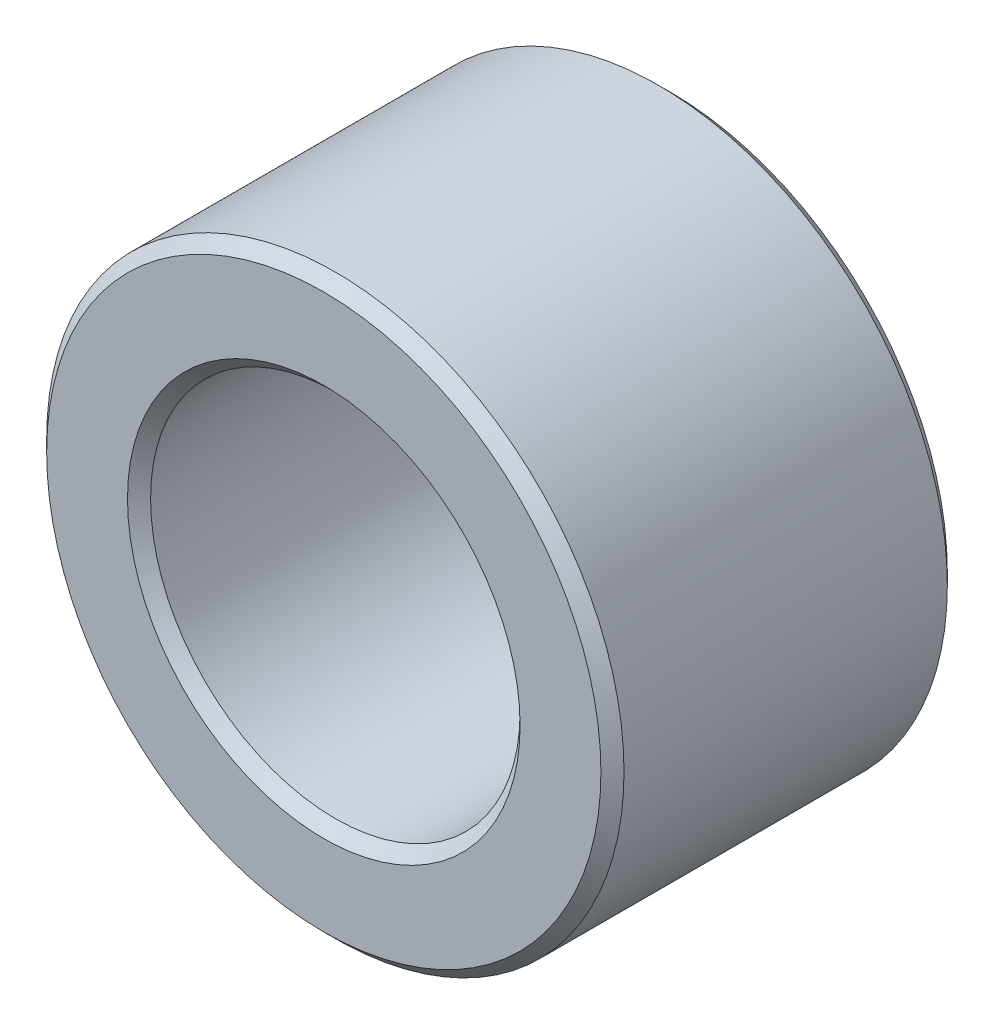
ISO-10303-21;
HEADER;
FILE_DESCRIPTION(('STEP AP214'),'2;1');
FILE_NAME('part.step','',(''),(''),'','','');
FILE_SCHEMA(('AUTOMOTIVE_DESIGN { 1 0 10303 214 1 1 1 1 }'));
ENDSEC;
DATA;
#1=APPLICATION_CONTEXT('core data for automotive mechanical design processes');
#2=APPLICATION_PROTOCOL_DEFINITION('international standard','automotive_design',2000,#1);
#3=PRODUCT_CONTEXT('',#1,'mechanical');
#4=PRODUCT('Part','Part','',(#3));
#5=PRODUCT_RELATED_PRODUCT_CATEGORY('part','',(#4));
#6=PRODUCT_DEFINITION_FORMATION('','',#4);
#7=PRODUCT_DEFINITION_CONTEXT('part definition',#1,'design');
#8=PRODUCT_DEFINITION('design','',#6,#7);
#9=PRODUCT_DEFINITION_SHAPE('','',#8);
#10=(LENGTH_UNIT() NAMED_UNIT(*) SI_UNIT(.MILLI.,.METRE.));
#11=(NAMED_UNIT(*) PLANE_ANGLE_UNIT() SI_UNIT($,.RADIAN.));
#12=(NAMED_UNIT(*) SI_UNIT($,.STERADIAN.) SOLID_ANGLE_UNIT());
#13=UNCERTAINTY_MEASURE_WITH_UNIT(LENGTH_MEASURE(1.E-05),#10,'distance_accuracy_value','');
#14=(GEOMETRIC_REPRESENTATION_CONTEXT(3) GLOBAL_UNCERTAINTY_ASSIGNED_CONTEXT((#13)) GLOBAL_UNIT_ASSIGNED_CONTEXT((#10,
#11,#12)) REPRESENTATION_CONTEXT('',''));
#15=CARTESIAN_POINT('',(0.,0.,0.));
#16=DIRECTION('',(0.,0.,1.));
#17=DIRECTION('',(1.,0.,0.));
#18=AXIS2_PLACEMENT_3D('',#15,#16,#17);
#19=CARTESIAN_POINT('',(0.,0.,3.));
#20=DIRECTION('',(0.,0.,1.));
#21=DIRECTION('',(1.,0.,0.));
#22=AXIS2_PLACEMENT_3D('',#19,#20,#21);
#23=PLANE('',#22);
#24=CARTESIAN_POINT('',(0.,0.,3.));
#25=DIRECTION('',(0.,0.,1.));
#26=DIRECTION('',(1.,0.,0.));
#27=AXIS2_PLACEMENT_3D('',#24,#25,#26);
#28=CIRCLE('',#27,3.4);
#29=CARTESIAN_POINT('',(3.4,0.,3.));
#30=VERTEX_POINT('',#29);
#31=EDGE_CURVE('E10',#30,#30,#28,.F.);
#32=ORIENTED_EDGE('',*,*,#31,.T.);
#33=EDGE_LOOP('',(#32));
#34=FACE_BOUND('',#33,.T.);
#35=CARTESIAN_POINT('',(0.,0.,3.));
#36=DIRECTION('',(0.,0.,1.));
#37=DIRECTION('',(1.,0.,0.));
#38=AXIS2_PLACEMENT_3D('',#35,#36,#37);
#39=CIRCLE('',#38,4.8);
#40=CARTESIAN_POINT('',(4.8,0.,3.));
#41=VERTEX_POINT('',#40);
#42=EDGE_CURVE('E45',#41,#41,#39,.T.);
#43=ORIENTED_EDGE('',*,*,#42,.T.);
#44=EDGE_LOOP('',(#43));
#45=FACE_BOUND('',#44,.T.);
#46=ADVANCED_FACE('F37',(#34,#45),#23,.T.);
#47=CARTESIAN_POINT('',(0.,0.,-3.));
#48=DIRECTION('',(0.,0.,1.));
#49=DIRECTION('',(1.,0.,0.));
#50=AXIS2_PLACEMENT_3D('',#47,#48,#49);
#51=PLANE('',#50);
#52=CARTESIAN_POINT('',(0.,0.,-3.));
#53=DIRECTION('',(0.,0.,1.));
#54=DIRECTION('',(1.,0.,0.));
#55=AXIS2_PLACEMENT_3D('',#52,#53,#54);
#56=CIRCLE('',#55,4.8);
#57=CARTESIAN_POINT('',(4.8,0.,-3.));
#58=VERTEX_POINT('',#57);
#59=EDGE_CURVE('E62',#58,#58,#56,.F.);
#60=ORIENTED_EDGE('',*,*,#59,.T.);
#61=EDGE_LOOP('',(#60));
#62=FACE_BOUND('',#61,.T.);
#63=CARTESIAN_POINT('',(0.,0.,-3.));
#64=DIRECTION('',(0.,0.,1.));
#65=DIRECTION('',(1.,0.,0.));
#66=AXIS2_PLACEMENT_3D('',#63,#64,#65);
#67=CIRCLE('',#66,3.4);
#68=CARTESIAN_POINT('',(3.4,0.,-3.));
#69=VERTEX_POINT('',#68);
#70=EDGE_CURVE('E66',#69,#69,#67,.T.);
#71=ORIENTED_EDGE('',*,*,#70,.T.);
#72=EDGE_LOOP('',(#71));
#73=FACE_BOUND('',#72,.T.);
#74=ADVANCED_FACE('F89',(#62,#73),#51,.F.);
#75=CARTESIAN_POINT('',(0.,0.,3.));
#76=DIRECTION('',(0.,0.,-1.));
#77=DIRECTION('',(-1.,0.,0.));
#78=AXIS2_PLACEMENT_3D('',#75,#76,#77);
#79=CYLINDRICAL_SURFACE('',#78,5.);
#80=CARTESIAN_POINT('',(0.,0.,-2.8));
#81=DIRECTION('',(0.,0.,1.));
#82=DIRECTION('',(1.,0.,0.));
#83=AXIS2_PLACEMENT_3D('',#80,#81,#82);
#84=CIRCLE('',#83,5.);
#85=CARTESIAN_POINT('',(5.,0.,-2.8));
#86=VERTEX_POINT('',#85);
#87=EDGE_CURVE('E69',#86,#86,#84,.T.);
#88=ORIENTED_EDGE('',*,*,#87,.T.);
#89=EDGE_LOOP('',(#88));
#90=FACE_BOUND('',#89,.T.);
#91=CARTESIAN_POINT('',(0.,0.,2.8));
#92=DIRECTION('',(0.,0.,1.));
#93=DIRECTION('',(1.,0.,0.));
#94=AXIS2_PLACEMENT_3D('',#91,#92,#93);
#95=CIRCLE('',#94,5.);
#96=CARTESIAN_POINT('',(5.,0.,2.8));
#97=VERTEX_POINT('',#96);
#98=EDGE_CURVE('E73',#97,#97,#95,.F.);
#99=ORIENTED_EDGE('',*,*,#98,.T.);
#100=EDGE_LOOP('',(#99));
#101=FACE_BOUND('',#100,.T.);
#102=ADVANCED_FACE('F78',(#90,#101),#79,.T.);
#103=CARTESIAN_POINT('',(0.,0.,3.));
#104=DIRECTION('',(0.,0.,-1.));
#105=DIRECTION('',(-1.,0.,0.));
#106=AXIS2_PLACEMENT_3D('',#103,#104,#105);
#107=CYLINDRICAL_SURFACE('',#106,3.2);
#108=CARTESIAN_POINT('',(0.,0.,-2.8));
#109=DIRECTION('',(0.,0.,1.));
#110=DIRECTION('',(1.,0.,0.));
#111=AXIS2_PLACEMENT_3D('',#108,#109,#110);
#112=CIRCLE('',#111,3.2);
#113=CARTESIAN_POINT('',(3.2,0.,-2.8));
#114=VERTEX_POINT('',#113);
#115=EDGE_CURVE('E51',#114,#114,#112,.F.);
#116=ORIENTED_EDGE('',*,*,#115,.T.);
#117=EDGE_LOOP('',(#116));
#118=FACE_BOUND('',#117,.T.);
#119=CARTESIAN_POINT('',(0.,0.,2.8));
#120=DIRECTION('',(0.,0.,1.));
#121=DIRECTION('',(1.,0.,0.));
#122=AXIS2_PLACEMENT_3D('',#119,#120,#121);
#123=CIRCLE('',#122,3.2);
#124=CARTESIAN_POINT('',(3.2,0.,2.8));
#125=VERTEX_POINT('',#124);
#126=EDGE_CURVE('E57',#125,#125,#123,.T.);
#127=ORIENTED_EDGE('',*,*,#126,.T.);
#128=EDGE_LOOP('',(#127));
#129=FACE_BOUND('',#128,.T.);
#130=ADVANCED_FACE('F97',(#118,#129),#107,.F.);
#131=CARTESIAN_POINT('',(0.,0.,-2.8));
#132=DIRECTION('',(0.,0.,1.));
#133=DIRECTION('',(1.,0.,0.));
#134=AXIS2_PLACEMENT_3D('',#131,#132,#133);
#135=CONICAL_SURFACE('',#134,5.,0.785398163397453);
#136=ORIENTED_EDGE('',*,*,#59,.F.);
#137=EDGE_LOOP('',(#136));
#138=FACE_BOUND('',#137,.T.);
#139=ORIENTED_EDGE('',*,*,#87,.F.);
#140=EDGE_LOOP('',(#139));
#141=FACE_BOUND('',#140,.T.);
#142=ADVANCED_FACE('F102',(#138,#141),#135,.T.);
#143=CARTESIAN_POINT('',(0.,0.,-3.));
#144=DIRECTION('',(0.,0.,-1.));
#145=DIRECTION('',(-1.,0.,0.));
#146=AXIS2_PLACEMENT_3D('',#143,#144,#145);
#147=CONICAL_SURFACE('',#146,3.4,0.785398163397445);
#148=ORIENTED_EDGE('',*,*,#115,.F.);
#149=EDGE_LOOP('',(#148));
#150=FACE_BOUND('',#149,.T.);
#151=ORIENTED_EDGE('',*,*,#70,.F.);
#152=EDGE_LOOP('',(#151));
#153=FACE_BOUND('',#152,.T.);
#154=ADVANCED_FACE('F86',(#150,#153),#147,.F.);
#155=CARTESIAN_POINT('',(0.,0.,2.8));
#156=DIRECTION('',(0.,0.,1.));
#157=DIRECTION('',(1.,0.,0.));
#158=AXIS2_PLACEMENT_3D('',#155,#156,#157);
#159=CONICAL_SURFACE('',#158,3.2,0.785398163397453);
#160=CARTESIAN_POINT('',(3.4,0.,3.));
#161=CARTESIAN_POINT('',(3.39791666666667,0.,2.99791666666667));
#162=CARTESIAN_POINT('',(3.39583333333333,0.,2.99583333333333));
#163=CARTESIAN_POINT('',(3.39166666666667,0.,2.99166666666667));
#164=CARTESIAN_POINT('',(3.38958333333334,0.,2.98958333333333));
#165=CARTESIAN_POINT('',(3.38541666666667,0.,2.98541666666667));
#166=CARTESIAN_POINT('',(3.38333333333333,0.,2.98333333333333));
#167=CARTESIAN_POINT('',(3.37916666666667,0.,2.97916666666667));
#168=CARTESIAN_POINT('',(3.37708333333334,0.,2.97708333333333));
#169=CARTESIAN_POINT('',(3.37291666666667,0.,2.97291666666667));
#170=CARTESIAN_POINT('',(3.37083333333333,0.,2.97083333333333));
#171=CARTESIAN_POINT('',(3.36666666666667,0.,2.96666666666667));
#172=CARTESIAN_POINT('',(3.36458333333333,0.,2.96458333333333));
#173=CARTESIAN_POINT('',(3.36041666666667,0.,2.96041666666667));
#174=CARTESIAN_POINT('',(3.35833333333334,0.,2.95833333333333));
#175=CARTESIAN_POINT('',(3.35416666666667,0.,2.95416666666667));
#176=CARTESIAN_POINT('',(3.35208333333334,0.,2.95208333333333));
#177=CARTESIAN_POINT('',(3.34791666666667,0.,2.94791666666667));
#178=CARTESIAN_POINT('',(3.34583333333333,0.,2.94583333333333));
#179=CARTESIAN_POINT('',(3.34166666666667,0.,2.94166666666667));
#180=CARTESIAN_POINT('',(3.33958333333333,0.,2.93958333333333));
#181=CARTESIAN_POINT('',(3.33541666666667,0.,2.93541666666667));
#182=CARTESIAN_POINT('',(3.33333333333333,0.,2.93333333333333));
#183=CARTESIAN_POINT('',(3.32916666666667,0.,2.92916666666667));
#184=CARTESIAN_POINT('',(3.32708333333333,0.,2.92708333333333));
#185=CARTESIAN_POINT('',(3.32291666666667,0.,2.92291666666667));
#186=CARTESIAN_POINT('',(3.32083333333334,0.,2.92083333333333));
#187=CARTESIAN_POINT('',(3.31666666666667,0.,2.91666666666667));
#188=CARTESIAN_POINT('',(3.31458333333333,0.,2.91458333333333));
#189=CARTESIAN_POINT('',(3.31041666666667,0.,2.91041666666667));
#190=CARTESIAN_POINT('',(3.30833333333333,0.,2.90833333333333));
#191=CARTESIAN_POINT('',(3.30416666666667,0.,2.90416666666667));
#192=CARTESIAN_POINT('',(3.30208333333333,0.,2.90208333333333));
#193=CARTESIAN_POINT('',(3.29791666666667,0.,2.89791666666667));
#194=CARTESIAN_POINT('',(3.29583333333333,0.,2.89583333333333));
#195=CARTESIAN_POINT('',(3.29166666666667,0.,2.89166666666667));
#196=CARTESIAN_POINT('',(3.28958333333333,0.,2.88958333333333));
#197=CARTESIAN_POINT('',(3.28541666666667,0.,2.88541666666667));
#198=CARTESIAN_POINT('',(3.28333333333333,0.,2.88333333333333));
#199=CARTESIAN_POINT('',(3.27916666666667,0.,2.87916666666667));
#200=CARTESIAN_POINT('',(3.27708333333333,0.,2.87708333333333));
#201=CARTESIAN_POINT('',(3.27291666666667,0.,2.87291666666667));
#202=CARTESIAN_POINT('',(3.27083333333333,0.,2.87083333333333));
#203=CARTESIAN_POINT('',(3.26666666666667,0.,2.86666666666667));
#204=CARTESIAN_POINT('',(3.26458333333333,0.,2.86458333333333));
#205=CARTESIAN_POINT('',(3.26041666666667,0.,2.86041666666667));
#206=CARTESIAN_POINT('',(3.25833333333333,0.,2.85833333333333));
#207=CARTESIAN_POINT('',(3.25416666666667,0.,2.85416666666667));
#208=CARTESIAN_POINT('',(3.25208333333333,0.,2.85208333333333));
#209=CARTESIAN_POINT('',(3.24791666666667,0.,2.84791666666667));
#210=CARTESIAN_POINT('',(3.24583333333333,0.,2.84583333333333));
#211=CARTESIAN_POINT('',(3.24166666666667,0.,2.84166666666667));
#212=CARTESIAN_POINT('',(3.23958333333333,0.,2.83958333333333));
#213=CARTESIAN_POINT('',(3.23541666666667,0.,2.83541666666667));
#214=CARTESIAN_POINT('',(3.23333333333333,0.,2.83333333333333));
#215=CARTESIAN_POINT('',(3.22916666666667,0.,2.82916666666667));
#216=CARTESIAN_POINT('',(3.22708333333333,0.,2.82708333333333));
#217=CARTESIAN_POINT('',(3.22291666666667,0.,2.82291666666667));
#218=CARTESIAN_POINT('',(3.22083333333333,0.,2.82083333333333));
#219=CARTESIAN_POINT('',(3.21666666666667,0.,2.81666666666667));
#220=CARTESIAN_POINT('',(3.21458333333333,0.,2.81458333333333));
#221=CARTESIAN_POINT('',(3.21041666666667,0.,2.81041666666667));
#222=CARTESIAN_POINT('',(3.20833333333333,0.,2.80833333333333));
#223=CARTESIAN_POINT('',(3.20416666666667,0.,2.80416666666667));
#224=CARTESIAN_POINT('',(3.20208333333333,0.,2.80208333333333));
#225=CARTESIAN_POINT('',(3.2,0.,2.8));
#226=B_SPLINE_CURVE_WITH_KNOTS('',3,(#160,#161,#162,#163,#164,#165,#166,#167,#168,#169,#170,
#171,#172,#173,#174,#175,#176,#177,#178,#179,#180,#181,#182,#183,#184,#185,#186,#187,#188,#189,
#190,#191,#192,#193,#194,#195,#196,#197,#198,#199,#200,#201,#202,#203,#204,#205,#206,#207,#208,
#209,#210,#211,#212,#213,#214,#215,#216,#217,#218,#219,#220,#221,#222,#223,#224,#225),
.UNSPECIFIED.,.F.,.F.,(4,2,2,2,2,2,2,2,2,2,2,2,2,2,2,2,2,2,2,2,2,2,2,2,2,2,2,2,2,2,2,2,4),(0.,
0.00883883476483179,0.0176776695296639,0.0265165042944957,0.0353553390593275,0.0441941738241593,
0.053033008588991,0.0618718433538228,0.0707106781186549,0.0795495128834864,0.0883883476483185,
0.0972271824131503,0.106066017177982,0.114904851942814,0.123743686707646,0.132582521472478,
0.14142135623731,0.150260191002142,0.159099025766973,0.167937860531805,0.176776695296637,
0.185615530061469,0.194454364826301,0.203293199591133,0.212132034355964,0.220970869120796,
0.229809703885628,0.23864853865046,0.247487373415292,0.256326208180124,0.265165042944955,
0.274003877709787,0.282842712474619),.UNSPECIFIED.);
#227=EDGE_CURVE('BSEAM82',#30,#125,#226,.T.);
#228=ORIENTED_EDGE('',*,*,#31,.F.);
#229=ORIENTED_EDGE('',*,*,#126,.F.);
#230=ORIENTED_EDGE('',*,*,#227,.T.);
#231=ORIENTED_EDGE('',*,*,#227,.F.);
#232=EDGE_LOOP('',(#228,#230,#229,#231));
#233=FACE_BOUND('',#232,.T.);
#234=ADVANCED_FACE('F82',(#233),#159,.F.);
#235=CARTESIAN_POINT('',(0.,0.,3.));
#236=DIRECTION('',(0.,0.,-1.));
#237=DIRECTION('',(-1.,0.,0.));
#238=AXIS2_PLACEMENT_3D('',#235,#236,#237);
#239=CONICAL_SURFACE('',#238,4.8,0.78539816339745);
#240=ORIENTED_EDGE('',*,*,#98,.F.);
#241=EDGE_LOOP('',(#240));
#242=FACE_BOUND('',#241,.T.);
#243=ORIENTED_EDGE('',*,*,#42,.F.);
#244=EDGE_LOOP('',(#243));
#245=FACE_BOUND('',#244,.T.);
#246=ADVANCED_FACE('F39',(#242,#245),#239,.T.);
#247=CLOSED_SHELL('',(#46,#74,#102,#130,#142,#154,#234,#246));
#248=MANIFOLD_SOLID_BREP('B2',#247);
#249=ADVANCED_BREP_SHAPE_REPRESENTATION('',(#18,#248),#14);
#250=SHAPE_DEFINITION_REPRESENTATION(#9,#249);
ENDSEC;
END-ISO-10303-21;
